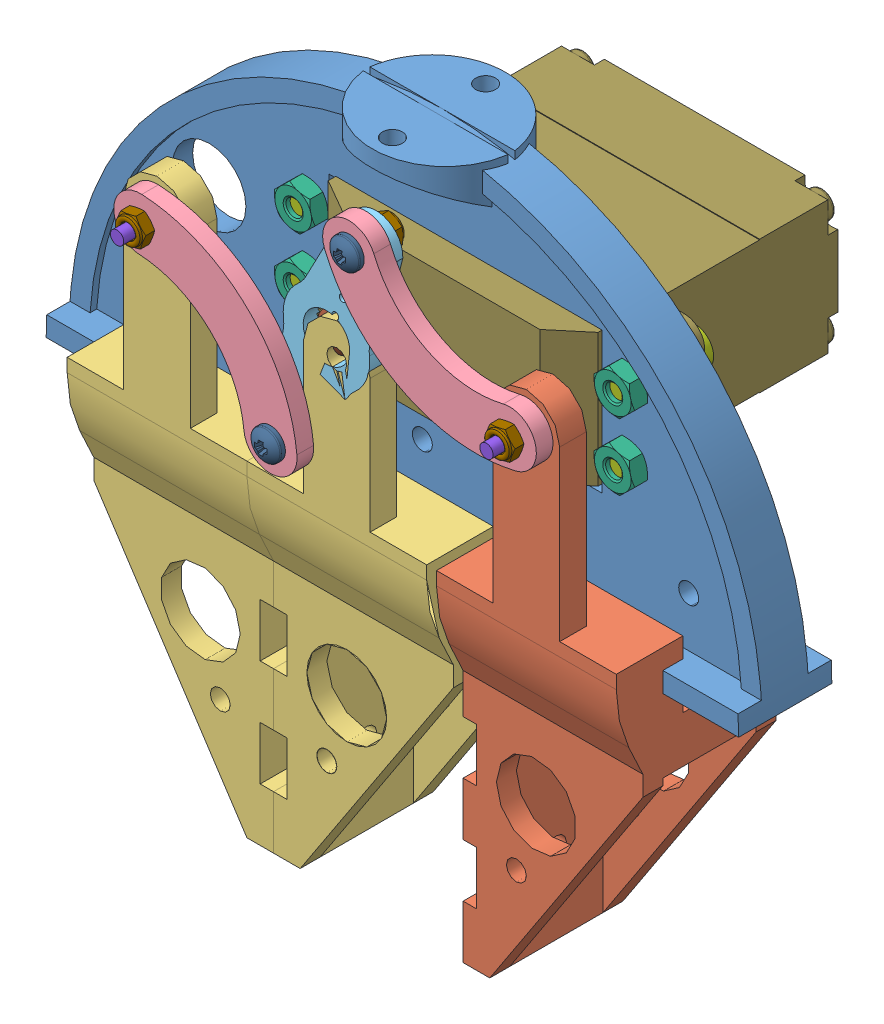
SolidWorks assembly 塑料平行爪 - 副本.SLDASM, configuration 默认 (file format 13000). Lengths in mm.
Overall size (104 99 52.9).
28 component instances, 12 part files, 40 mates.
Components (placement in the parent):
- 手抓-1: 手抓.SLDPRT [默认] at origin size (104 52 20)
- 指步1-1: 指步1.SLDPRT [默认] at (67.6231 -47 0) x (1 0 0) z (0 0 -1) size (27 83.3 24)
- 指步2-1: 指步2.SLDPRT [默认] at (39.1508 -47 0) x (1 0 0) z (0 0 -1) size (54 83.3 24)
- 连杆-1: 连杆.SLDPRT [默认] at (79.1231 31.3 15.25) x (0 0 1) z (0.892824 -0.450406 0) size (2.5 13 35)
- 舵机连接板-1: 舵机连接板.SLDPRT [默认] at (49.0988 28.0588 14) x (-0.358667 -0.933466 0) z (0 0 -1) size (38.5 13 7)
- 连杆-2: 连杆.SLDPRT [默认] at (43.1808 12.6566 15.25) x (0 0 -1) z (0.723336 -0.690496 0) size (2.5 13 35)
- GB6170-M3-ZN-10-1: GB6170-M3-ZN-10.SLDPRT [Default] at (83 33.2143 -0.5) x (0.698338 -0.715768 0) z (0 0 1) size (5.5 6.35 2.4) (hidden)
- GB818-M3X10-ZN-4.8-1: GB818-M3X10-ZN-4.8.SLDPRT [Default] at (83 33.2143 4.1) x (-0.332292 0.943176 0) z (0 0 -1) size (5.6 5.6 12.4)
- GB6170-M3-ZN-10-2: GB6170-M3-ZN-10.SLDPRT [Default] at (83 33.2143 4.9) x (0.698338 -0.715768 0) z (0 0 1) size (5.5 6.35 2.4)
- GB6170-M3-ZN-10-3: GB6170-M3-ZN-10.SLDPRT [Default] at (83 23.2143 -0.5) x (0.698338 -0.715768 0) z (0 0 1) size (5.5 6.35 2.4)
- GB6170-M3-ZN-10-4: GB6170-M3-ZN-10.SLDPRT [Default] at (35 33.2143 -0.5) x (0.698338 -0.715768 0) z (0 0 1) size (5.5 6.35 2.4)
- GB6170-M3-ZN-10-5: GB6170-M3-ZN-10.SLDPRT [Default] at (35 23.2143 -0.5) x (0.698338 -0.715768 0) z (0 0 1) size (5.5 6.35 2.4)
- GB6170-M3-ZN-10-6: GB6170-M3-ZN-10.SLDPRT [Default] at (83 23.2143 4.9) x (0.698338 -0.715768 0) z (0 0 1) size (5.5 6.35 2.4)
- GB6170-M3-ZN-10-7: GB6170-M3-ZN-10.SLDPRT [Default] at (35 33.2143 4.9) x (0.698338 -0.715768 0) z (0 0 1) size (5.5 6.35 2.4)
- GB6170-M3-ZN-10-8: GB6170-M3-ZN-10.SLDPRT [Default] at (35 23.2143 4.9) x (0.698338 -0.715768 0) z (0 0 1) size (5.5 6.35 2.4)
- GB818-M3X10-ZN-4.8-2: GB818-M3X10-ZN-4.8.SLDPRT [Default] at (83 23.2143 4.1) x (-0.332292 0.943176 0) z (0 0 -1) size (5.6 5.6 12.4)
- GB818-M3X10-ZN-4.8-3: GB818-M3X10-ZN-4.8.SLDPRT [Default] at (35 33.2143 4.1) x (-0.332292 0.943176 0) z (0 0 -1) size (5.6 5.6 12.4)
- GB818-M3X10-ZN-4.8-4: GB818-M3X10-ZN-4.8.SLDPRT [Default] at (35 23.2143 4.1) x (-0.332292 0.943176 0) z (0 0 -1) size (5.6 5.6 12.4)
- GB818-M2X10-4.8-1: GB818-M2X10-4.8.SLDPRT [Default] at (23.6508 31.3 8.4) x (0 0 1) z (-0.404525 0.914527 0) size (11.53 4.5 4.5)
- GB818-M2X10-4.8-2: GB818-M2X10-4.8.SLDPRT [Default] at (79.1231 31.3 8.4) x (0 0 1) z (-0.404525 0.914527 0) size (11.53 4.5 4.5)
- GB6170-M2（自锁）-1: GB6170-M2（自锁）.SLDPRT [默认] at (23.6508 31.3 16.5) x (-0.769474 -0.638678 0) z (-0.638678 0.769474 0) size (4 2.04 4.62)
- GB6170-M2（自锁）-2: GB6170-M2（自锁）.SLDPRT [默认] at (79.1231 31.3 16.5) x (-0.769474 -0.638678 0) z (-0.638678 0.769474 0) size (4 2.04 4.62)
- GB818-M2X6-1: GB818-M2X6.SLDPRT [Default] at (43.1808 12.6566 18.1) x (0 0 -1) z (1 0 0) size (7.53 4.5 4.5)
- GB818-M2X6-2: GB818-M2X6.SLDPRT [Default] at (55.0168 43.461 18.1) x (0 0 -1) z (1 0 0) size (7.53 4.5 4.5)
- GB6170-M2（自锁）-3: GB6170-M2（自锁）.SLDPRT [默认] at (43.1808 12.6566 12) x (0.999872 0.016015 0) z (-0.016015 0.999872 0) size (4 2.04 4.62)
- GB6170-M2（自锁）-4: GB6170-M2（自锁）.SLDPRT [默认] at (55.0168 43.461 12) x (0.999872 0.016015 0) z (-0.016015 0.999872 0) size (4 2.04 4.62)
- GB818-M3X6-ZN-4.8-1: GB818-M3X6-ZN-4.8.SLDPRT [Default] at (49.0988 28.0588 4.9913) x (0.972378 0.233412 0) z (0 0 1) size (5.6 5.6 8.4)
- 单轴舵机-1: 单轴舵机.SLDPRT [默认] at (59 38.2143 -12.9) x (0 0 1) z (0 -1 0) size (45 56 20)
Mates (geometry in assembly coordinates):
- 重合1: coincident anti-aligned: plane of 手抓-1 through (52 0 7) normal (0 0 1); plane of 指步1-1 through (37.3211 0 7) normal (0 0 -1)
- 重合2: coincident anti-aligned: plane of 手抓-1 through (0 0 7) normal (0 -1 0); plane of 指步1-1 through (37.3211 0 4) normal (0 1 0)
- 重合3: coincident anti-aligned: plane of 手抓-1 through (0 0 7) normal (0 -1 0); plane of 指步2-1 through (65.4527 0 4) normal (0 1 0)
- 重合4: coincident anti-aligned: plane of 手抓-1 through (52 0 -7) normal (0 0 -1); plane of 指步2-1 through (65.4527 0 -7) normal (0 0 1)
- 同心1: concentric: cylinder of 指步1-1 through (66.3097 26 10) axis (0 0 1) radius 1; cylinder of 连杆-1 through (89.2576 31.3 16.5) axis (0 0 -1) radius 1
- 重合5: coincident anti-aligned: plane of 指步1-1 through (37.3211 4 14) normal (0 0 1); plane of 连杆-1 through (64.5847 47.4405 14) normal (0 0 -1)
- 同心2: concentric aligned: cylinder of 连杆-1 through (55.0168 43.461 16.5) axis (0 0 -1) radius 1; cylinder of 舵机连接板-1 through (55.0168 43.461 22) axis (0 0 -1) radius 1.5
- 重合6: coincident anti-aligned: plane of 连杆-1 through (64.5847 47.4405 14) normal (0 0 -1); plane of 舵机连接板-1 through (41.5673 36.7493 14) normal (0 0 1)
- 同心3: concentric anti-aligned: cylinder of 舵机连接板-1 through (43.1808 12.6566 22) axis (0 0 -1) radius 1.5; cylinder of 连杆-2 through (43.1808 12.6566 14) axis (0 0 1) radius 1
- 重合7: coincident anti-aligned: plane of 舵机连接板-1 through (41.5673 36.7493 14) normal (0 0 1); plane of 连杆-2 through (23.1043 20.9519 14) normal (0 0 -1)
- 同心4: concentric: cylinder of 指步2-1 through (4.1981 26 10) axis (0 0 1) radius 1.5; cylinder of 连杆-2 through (5.1142 31.3 14) axis (0 0 1) radius 1
- 同心11: concentric aligned: cylinder of GB6170-M3-ZN-10-1 through (83 33.2143 -2.9) axis (0 0 1) radius 1.25; cylinder of GB818-M3X10-ZN-4.8-1 through (83 33.2143 -5.9) axis (0 0 1) radius 1.5
- 重合12: coincident anti-aligned: plane of 手抓-1 through (52 0 -0.5) normal (0 0 -1); plane of GB6170-M3-ZN-10-1 through (85.2729 35.4319 -0.5) normal (0 0 1)
- 同心12: concentric aligned: cylinder of GB818-M3X10-ZN-4.8-1 through (83 33.2143 -5.9) axis (0 0 1) radius 1.5; cylinder of GB6170-M3-ZN-10-2 through (83 33.2143 2.5) axis (0 0 1) radius 1.25
- 重合13: coincident anti-aligned: plane of 手抓-1 through (52 0 2.5) normal (0 0 1); plane of GB6170-M3-ZN-10-2 through (85.2729 35.4319 2.5) normal (0 0 -1)
- 同心13: concentric: cylinder of 指步2-1 through (4.1981 26 10) axis (0 0 1) radius 1.5; cylinder of GB818-M2X10-4.8-1 through (5.1142 31.3 -17) axis (0 0 -1) radius 1
- 重合14: coincident anti-aligned: plane of 指步2-1 through (23.6508 26 10) normal (0 0 -1); plane of GB818-M2X10-4.8-1 through (24.5653 31.7045 10) normal (0 0 1)
- 同心14: concentric aligned: cylinder of 连杆-1 through (79.1231 31.3 16.5) axis (0 0 -1) radius 1; cylinder of GB818-M2X10-4.8-2 through (79.1231 31.3 -17) axis (0 0 -1) radius 1
- 重合15: coincident aligned: plane of GB818-M2X10-4.8-1 through (24.5653 31.7045 20) normal (0 0 1); plane of GB818-M2X10-4.8-2 through (80.0376 31.7045 20) normal (0 0 1)
- 同心15: concentric anti-aligned: cylinder of GB818-M2X10-4.8-1 through (23.6508 31.3 -17) axis (0 0 -1) radius 1; cylinder of GB6170-M2（自锁）-1 through (23.6508 31.3 18.1) axis (0 0 1) radius 1
- 重合16: coincident anti-aligned: plane of 连杆-2 through (23.1043 20.9519 16.5) normal (0 0 1); plane of GB6170-M2（自锁）-1 through (26.7287 33.8547 16.5) normal (0 0 -1)
- 同心16: concentric anti-aligned: cylinder of GB818-M2X10-4.8-2 through (79.1231 31.3 -17) axis (0 0 -1) radius 1; cylinder of GB6170-M2（自锁）-2 through (79.1231 31.3 18.1) axis (0 0 1) radius 1
- 重合17: coincident anti-aligned: plane of 连杆-1 through (64.5847 47.4405 16.5) normal (0 0 1); plane of GB6170-M2（自锁）-2 through (82.201 33.8547 16.5) normal (0 0 -1)
- 同心171: concentric aligned: cylinder of 连杆-2 through (43.1808 12.6566 14) axis (0 0 1) radius 1; cylinder of GB818-M2X6-1 through (43.1808 12.6566 43.5) axis (0 0 1) radius 2.25
- 重合181: coincident anti-aligned: plane of 连杆-2 through (23.1043 20.9519 16.5) normal (0 0 1); plane of GB818-M2X6-1 through (43.1808 13.6566 16.5) normal (0 0 -1)
- 同心181: concentric anti-aligned: cylinder of 连杆-1 through (55.0168 43.461 16.5) axis (0 0 -1) radius 1; cylinder of GB818-M2X6-2 through (55.0168 43.461 43.5) axis (0 0 1) radius 2.25
- 重合191: coincident anti-aligned: plane of 连杆-1 through (64.5847 47.4405 16.5) normal (0 0 1); plane of GB818-M2X6-2 through (55.0168 44.461 16.5) normal (0 0 -1)
- 重合20: coincident anti-aligned: plane of 舵机连接板-1 through (41.5673 36.7493 12) normal (0 0 -1); plane of GB6170-M2（自锁）-3 through (39.1814 12.5925 12) normal (0 0 1)
- 同心19: concentric anti-aligned: cylinder of GB818-M2X6-1 through (43.1808 12.6566 43.5) axis (0 0 1) radius 1; cylinder of GB6170-M2（自锁）-3 through (43.1808 12.6566 10.4) axis (0 0 -1) radius 1
- 同心20: concentric anti-aligned: cylinder of GB818-M2X6-2 through (55.0168 43.461 43.5) axis (0 0 1) radius 1; cylinder of GB6170-M2（自锁）-4 through (55.0168 43.461 10.4) axis (0 0 -1) radius 1
- 重合21: coincident anti-aligned: plane of 舵机连接板-1 through (41.5673 36.7493 12) normal (0 0 -1); plane of GB6170-M2（自锁）-4 through (51.0174 43.3969 12) normal (0 0 1)
- 同心182: concentric anti-aligned: cylinder of 舵机连接板-1 through (49.0988 28.0588 10) axis (0 0 1) radius 3.5; cylinder of GB818-M3X6-ZN-4.8-1 through (49.0988 28.0588 4.5977) axis (0 0 -1) radius 2.8
- 重合192: coincident anti-aligned: plane of GB6170-M3-ZN-10-5 through (37.2729 25.4319 -2.9) normal (0 0 -1); plane of 单轴舵机-1 through (86 18.3143 -2.9) normal (0 0 1)
- 同心184: concentric aligned: cylinder of GB818-M3X10-ZN-4.8-4 through (35 23.2143 -5.9) axis (0 0 1) radius 1.5; cylinder of 单轴舵机-1 through (35 23.2143 -10.2) axis (0 0 1) radius 2.25
- 同心185: concentric aligned: cylinder of GB818-M3X10-ZN-4.8-3 through (35 33.2143 -5.9) axis (0 0 1) radius 1.5; cylinder of 单轴舵机-1 through (35 33.2143 -10.2) axis (0 0 1) radius 2.25
- 同心186: concentric anti-aligned: cylinder of 指步1-1 through (79.1231 31.3 10) axis (0 0 1) radius 1; cylinder of GB818-M2X10-4.8-2 through (79.1231 31.3 -17) axis (0 0 -1) radius 1
- 同心187: concentric anti-aligned: cylinder of 指步2-1 through (23.6508 31.3 10) axis (0 0 1) radius 1; cylinder of GB818-M2X10-4.8-1 through (23.6508 31.3 -17) axis (0 0 -1) radius 1
- 同心188: concentric anti-aligned: cylinder of 连杆-2 through (23.6508 31.3 14) axis (0 0 1) radius 1; cylinder of GB818-M2X10-4.8-1 through (23.6508 31.3 -17) axis (0 0 -1) radius 1
- 重合193: coincident anti-aligned: plane of 手抓-1 through (79 38 7) normal (-1 0 0); plane of 单轴舵机-1 through (79 18.2143 -32.9) normal (1 0 0)
- 同心190: concentric aligned: cylinder of 舵机连接板-1 through (49.0988 28.0588 7) axis (0 0 1) radius 4.5; cylinder of 单轴舵机-1 through (49.0988 28.0588 8.1) axis (0 0 1) radius 1.5
